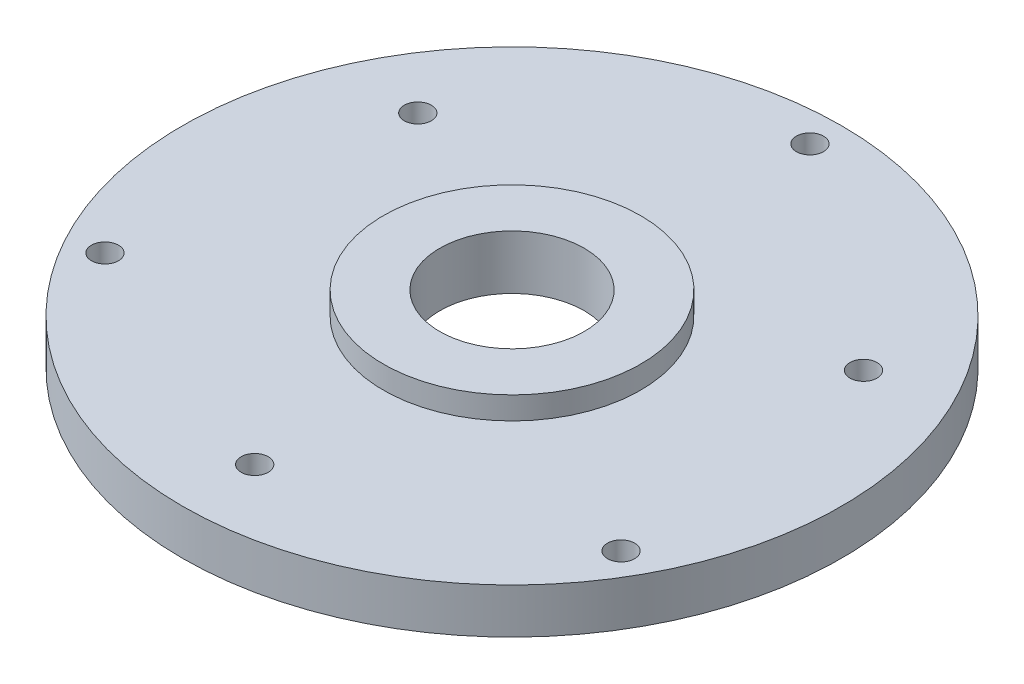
ISO-10303-21;
HEADER;
FILE_DESCRIPTION(('STEP AP214'),'2;1');
FILE_NAME('part.step','',(''),(''),'','','');
FILE_SCHEMA(('AUTOMOTIVE_DESIGN { 1 0 10303 214 1 1 1 1 }'));
ENDSEC;
DATA;
#1=APPLICATION_CONTEXT('core data for automotive mechanical design processes');
#2=APPLICATION_PROTOCOL_DEFINITION('international standard','automotive_design',2000,#1);
#3=PRODUCT_CONTEXT('',#1,'mechanical');
#4=PRODUCT('Part','Part','',(#3));
#5=PRODUCT_RELATED_PRODUCT_CATEGORY('part','',(#4));
#6=PRODUCT_DEFINITION_FORMATION('','',#4);
#7=PRODUCT_DEFINITION_CONTEXT('part definition',#1,'design');
#8=PRODUCT_DEFINITION('design','',#6,#7);
#9=PRODUCT_DEFINITION_SHAPE('','',#8);
#10=(LENGTH_UNIT() NAMED_UNIT(*) SI_UNIT(.MILLI.,.METRE.));
#11=(NAMED_UNIT(*) PLANE_ANGLE_UNIT() SI_UNIT($,.RADIAN.));
#12=(NAMED_UNIT(*) SI_UNIT($,.STERADIAN.) SOLID_ANGLE_UNIT());
#13=UNCERTAINTY_MEASURE_WITH_UNIT(LENGTH_MEASURE(1.E-05),#10,'distance_accuracy_value','');
#14=(GEOMETRIC_REPRESENTATION_CONTEXT(3) GLOBAL_UNCERTAINTY_ASSIGNED_CONTEXT((#13)) GLOBAL_UNIT_ASSIGNED_CONTEXT((#10,
#11,#12)) REPRESENTATION_CONTEXT('',''));
#15=CARTESIAN_POINT('',(0.,0.,0.));
#16=DIRECTION('',(0.,0.,1.));
#17=DIRECTION('',(1.,0.,0.));
#18=AXIS2_PLACEMENT_3D('',#15,#16,#17);
#19=CARTESIAN_POINT('',(0.,0.,0.));
#20=DIRECTION('',(0.,-1.,0.));
#21=DIRECTION('',(0.,0.,-1.));
#22=AXIS2_PLACEMENT_3D('',#19,#20,#21);
#23=CYLINDRICAL_SURFACE('',#22,14.25);
#24=CARTESIAN_POINT('',(0.,41.8859311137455,0.));
#25=DIRECTION('',(0.,-1.,0.));
#26=DIRECTION('',(0.,0.,-1.));
#27=AXIS2_PLACEMENT_3D('',#24,#25,#26);
#28=CIRCLE('',#27,14.25);
#29=CARTESIAN_POINT('',(0.,41.8859311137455,-14.25));
#30=VERTEX_POINT('',#29);
#31=EDGE_CURVE('E10',#30,#30,#28,.T.);
#32=ORIENTED_EDGE('',*,*,#31,.T.);
#33=EDGE_LOOP('',(#32));
#34=FACE_BOUND('',#33,.T.);
#35=CARTESIAN_POINT('',(0.,39.3859311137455,0.));
#36=DIRECTION('',(0.,-1.,0.));
#37=DIRECTION('',(0.,0.,-1.));
#38=AXIS2_PLACEMENT_3D('',#35,#36,#37);
#39=CIRCLE('',#38,14.25);
#40=CARTESIAN_POINT('',(0.,39.3859311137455,-14.25));
#41=VERTEX_POINT('',#40);
#42=EDGE_CURVE('E93',#41,#41,#39,.T.);
#43=ORIENTED_EDGE('',*,*,#42,.F.);
#44=EDGE_LOOP('',(#43));
#45=FACE_BOUND('',#44,.T.);
#46=ADVANCED_FACE('F45',(#34,#45),#23,.T.);
#47=CARTESIAN_POINT('',(8.,41.8859311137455,0.));
#48=DIRECTION('',(0.,1.,0.));
#49=DIRECTION('',(0.,0.,1.));
#50=AXIS2_PLACEMENT_3D('',#47,#48,#49);
#51=PLANE('',#50);
#52=CARTESIAN_POINT('',(0.,41.8859311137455,0.));
#53=DIRECTION('',(0.,-1.,0.));
#54=DIRECTION('',(0.,0.,-1.));
#55=AXIS2_PLACEMENT_3D('',#52,#53,#54);
#56=CIRCLE('',#55,8.);
#57=CARTESIAN_POINT('',(0.,41.8859311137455,-8.));
#58=VERTEX_POINT('',#57);
#59=EDGE_CURVE('E53',#58,#58,#56,.T.);
#60=ORIENTED_EDGE('',*,*,#59,.T.);
#61=EDGE_LOOP('',(#60));
#62=FACE_BOUND('',#61,.T.);
#63=ORIENTED_EDGE('',*,*,#31,.F.);
#64=EDGE_LOOP('',(#63));
#65=FACE_BOUND('',#64,.T.);
#66=ADVANCED_FACE('F133',(#62,#65),#51,.T.);
#67=CARTESIAN_POINT('',(0.,0.,0.));
#68=DIRECTION('',(0.,-1.,0.));
#69=DIRECTION('',(0.,0.,-1.));
#70=AXIS2_PLACEMENT_3D('',#67,#68,#69);
#71=CYLINDRICAL_SURFACE('',#70,8.);
#72=CARTESIAN_POINT('',(0.,35.8859311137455,0.));
#73=DIRECTION('',(0.,-1.,0.));
#74=DIRECTION('',(0.,0.,-1.));
#75=AXIS2_PLACEMENT_3D('',#72,#73,#74);
#76=CIRCLE('',#75,8.);
#77=CARTESIAN_POINT('',(0.,35.8859311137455,-8.));
#78=VERTEX_POINT('',#77);
#79=EDGE_CURVE('E60',#78,#78,#76,.T.);
#80=ORIENTED_EDGE('',*,*,#79,.T.);
#81=EDGE_LOOP('',(#80));
#82=FACE_BOUND('',#81,.T.);
#83=ORIENTED_EDGE('',*,*,#59,.F.);
#84=EDGE_LOOP('',(#83));
#85=FACE_BOUND('',#84,.T.);
#86=ADVANCED_FACE('F118',(#82,#85),#71,.F.);
#87=CARTESIAN_POINT('',(14.,35.8859311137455,0.));
#88=DIRECTION('',(0.,-1.,0.));
#89=DIRECTION('',(0.,0.,-1.));
#90=AXIS2_PLACEMENT_3D('',#87,#88,#89);
#91=PLANE('',#90);
#92=CARTESIAN_POINT('',(0.,35.8859311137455,0.));
#93=DIRECTION('',(0.,-1.,0.));
#94=DIRECTION('',(0.,0.,-1.));
#95=AXIS2_PLACEMENT_3D('',#92,#93,#94);
#96=CIRCLE('',#95,14.);
#97=CARTESIAN_POINT('',(0.,35.8859311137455,-14.));
#98=VERTEX_POINT('',#97);
#99=EDGE_CURVE('E110',#98,#98,#96,.T.);
#100=ORIENTED_EDGE('',*,*,#99,.T.);
#101=EDGE_LOOP('',(#100));
#102=FACE_BOUND('',#101,.T.);
#103=ORIENTED_EDGE('',*,*,#79,.F.);
#104=EDGE_LOOP('',(#103));
#105=FACE_BOUND('',#104,.T.);
#106=ADVANCED_FACE('F121',(#102,#105),#91,.T.);
#107=CARTESIAN_POINT('',(0.,0.,0.));
#108=DIRECTION('',(0.,-1.,0.));
#109=DIRECTION('',(0.,0.,-1.));
#110=AXIS2_PLACEMENT_3D('',#107,#108,#109);
#111=CYLINDRICAL_SURFACE('',#110,14.);
#112=CARTESIAN_POINT('',(0.,34.3859311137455,0.));
#113=DIRECTION('',(0.,-1.,0.));
#114=DIRECTION('',(0.,0.,-1.));
#115=AXIS2_PLACEMENT_3D('',#112,#113,#114);
#116=CIRCLE('',#115,14.);
#117=CARTESIAN_POINT('',(0.,34.3859311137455,-14.));
#118=VERTEX_POINT('',#117);
#119=EDGE_CURVE('E106',#118,#118,#116,.T.);
#120=ORIENTED_EDGE('',*,*,#119,.T.);
#121=EDGE_LOOP('',(#120));
#122=FACE_BOUND('',#121,.T.);
#123=ORIENTED_EDGE('',*,*,#99,.F.);
#124=EDGE_LOOP('',(#123));
#125=FACE_BOUND('',#124,.T.);
#126=ADVANCED_FACE('F123',(#122,#125),#111,.F.);
#127=CARTESIAN_POINT('',(14.,34.3859311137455,0.));
#128=DIRECTION('',(0.,-1.,0.));
#129=DIRECTION('',(0.,0.,-1.));
#130=AXIS2_PLACEMENT_3D('',#127,#128,#129);
#131=PLANE('',#130);
#132=CARTESIAN_POINT('',(0.,34.3859311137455,28.5));
#133=DIRECTION('',(0.,-1.,0.));
#134=DIRECTION('',(0.,0.,-1.));
#135=AXIS2_PLACEMENT_3D('',#132,#133,#134);
#136=CIRCLE('',#135,1.5);
#137=CARTESIAN_POINT('',(0.,34.3859311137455,27.));
#138=VERTEX_POINT('',#137);
#139=EDGE_CURVE('E68',#138,#138,#136,.T.);
#140=ORIENTED_EDGE('',*,*,#139,.F.);
#141=EDGE_LOOP('',(#140));
#142=FACE_BOUND('',#141,.T.);
#143=CARTESIAN_POINT('',(24.6817240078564,34.3859311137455,-14.2500000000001));
#144=DIRECTION('',(0.,-1.,0.));
#145=DIRECTION('',(0.,0.,-1.));
#146=AXIS2_PLACEMENT_3D('',#143,#144,#145);
#147=CIRCLE('',#146,1.5);
#148=CARTESIAN_POINT('',(24.6817240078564,34.3859311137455,-15.7500000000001));
#149=VERTEX_POINT('',#148);
#150=EDGE_CURVE('E194',#149,#149,#147,.T.);
#151=ORIENTED_EDGE('',*,*,#150,.F.);
#152=EDGE_LOOP('',(#151));
#153=FACE_BOUND('',#152,.T.);
#154=CARTESIAN_POINT('',(-24.6817240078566,34.3859311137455,-14.2499999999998));
#155=DIRECTION('',(0.,-1.,0.));
#156=DIRECTION('',(0.,0.,-1.));
#157=AXIS2_PLACEMENT_3D('',#154,#155,#156);
#158=CIRCLE('',#157,1.5);
#159=CARTESIAN_POINT('',(-24.6817240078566,34.3859311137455,-15.7499999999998));
#160=VERTEX_POINT('',#159);
#161=EDGE_CURVE('E199',#160,#160,#158,.T.);
#162=ORIENTED_EDGE('',*,*,#161,.F.);
#163=EDGE_LOOP('',(#162));
#164=FACE_BOUND('',#163,.T.);
#165=CARTESIAN_POINT('',(0.,34.3859311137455,-33.));
#166=DIRECTION('',(0.,1.,0.));
#167=DIRECTION('',(0.,0.,1.));
#168=AXIS2_PLACEMENT_3D('',#165,#166,#167);
#169=CIRCLE('',#168,1.5);
#170=CARTESIAN_POINT('',(0.,34.3859311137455,-31.5));
#171=VERTEX_POINT('',#170);
#172=EDGE_CURVE('E98',#171,#171,#169,.T.);
#173=ORIENTED_EDGE('',*,*,#172,.T.);
#174=EDGE_LOOP('',(#173));
#175=FACE_BOUND('',#174,.T.);
#176=CARTESIAN_POINT('',(28.5788383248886,34.3859311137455,16.4999999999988));
#177=DIRECTION('',(0.,1.,0.));
#178=DIRECTION('',(0.,0.,1.));
#179=AXIS2_PLACEMENT_3D('',#176,#177,#178);
#180=CIRCLE('',#179,1.5000000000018);
#181=CARTESIAN_POINT('',(28.5788383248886,34.3859311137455,18.0000000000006));
#182=VERTEX_POINT('',#181);
#183=EDGE_CURVE('E212',#182,#182,#180,.T.);
#184=ORIENTED_EDGE('',*,*,#183,.T.);
#185=EDGE_LOOP('',(#184));
#186=FACE_BOUND('',#185,.T.);
#187=CARTESIAN_POINT('',(-28.5788383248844,34.3859311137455,16.5000000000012));
#188=DIRECTION('',(0.,1.,0.));
#189=DIRECTION('',(0.,0.,1.));
#190=AXIS2_PLACEMENT_3D('',#187,#188,#189);
#191=CIRCLE('',#190,1.50000000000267);
#192=CARTESIAN_POINT('',(-28.5788383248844,34.3859311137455,18.0000000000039));
#193=VERTEX_POINT('',#192);
#194=EDGE_CURVE('E82',#193,#193,#191,.T.);
#195=ORIENTED_EDGE('',*,*,#194,.T.);
#196=EDGE_LOOP('',(#195));
#197=FACE_BOUND('',#196,.T.);
#198=CARTESIAN_POINT('',(0.,34.3859311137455,0.));
#199=DIRECTION('',(0.,-1.,0.));
#200=DIRECTION('',(0.,0.,-1.));
#201=AXIS2_PLACEMENT_3D('',#198,#199,#200);
#202=CIRCLE('',#201,36.5);
#203=CARTESIAN_POINT('',(0.,34.3859311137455,-36.5));
#204=VERTEX_POINT('',#203);
#205=EDGE_CURVE('E102',#204,#204,#202,.T.);
#206=ORIENTED_EDGE('',*,*,#205,.T.);
#207=EDGE_LOOP('',(#206));
#208=FACE_BOUND('',#207,.T.);
#209=ORIENTED_EDGE('',*,*,#119,.F.);
#210=EDGE_LOOP('',(#209));
#211=FACE_BOUND('',#210,.T.);
#212=ADVANCED_FACE('F130',(#142,#153,#164,#175,#186,#197,#208,#211),#131,.T.);
#213=CARTESIAN_POINT('',(0.,0.,0.));
#214=DIRECTION('',(0.,-1.,0.));
#215=DIRECTION('',(0.,0.,-1.));
#216=AXIS2_PLACEMENT_3D('',#213,#214,#215);
#217=CYLINDRICAL_SURFACE('',#216,36.5);
#218=CARTESIAN_POINT('',(0.,39.3859311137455,0.));
#219=DIRECTION('',(0.,-1.,0.));
#220=DIRECTION('',(0.,0.,-1.));
#221=AXIS2_PLACEMENT_3D('',#218,#219,#220);
#222=CIRCLE('',#221,36.5);
#223=CARTESIAN_POINT('',(0.,39.3859311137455,-36.5));
#224=VERTEX_POINT('',#223);
#225=EDGE_CURVE('E97',#224,#224,#222,.T.);
#226=ORIENTED_EDGE('',*,*,#225,.T.);
#227=EDGE_LOOP('',(#226));
#228=FACE_BOUND('',#227,.T.);
#229=ORIENTED_EDGE('',*,*,#205,.F.);
#230=EDGE_LOOP('',(#229));
#231=FACE_BOUND('',#230,.T.);
#232=ADVANCED_FACE('F147',(#228,#231),#217,.T.);
#233=CARTESIAN_POINT('',(14.25,39.3859311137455,0.));
#234=DIRECTION('',(0.,1.,0.));
#235=DIRECTION('',(0.,0.,1.));
#236=AXIS2_PLACEMENT_3D('',#233,#234,#235);
#237=PLANE('',#236);
#238=CARTESIAN_POINT('',(0.,39.3859311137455,28.5));
#239=DIRECTION('',(0.,1.,0.));
#240=DIRECTION('',(0.,0.,1.));
#241=AXIS2_PLACEMENT_3D('',#238,#239,#240);
#242=CIRCLE('',#241,1.5);
#243=CARTESIAN_POINT('',(0.,39.3859311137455,30.));
#244=VERTEX_POINT('',#243);
#245=EDGE_CURVE('E48',#244,#244,#242,.T.);
#246=ORIENTED_EDGE('',*,*,#245,.F.);
#247=EDGE_LOOP('',(#246));
#248=FACE_BOUND('',#247,.T.);
#249=CARTESIAN_POINT('',(24.6817240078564,39.3859311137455,-14.2500000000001));
#250=DIRECTION('',(0.,1.,0.));
#251=DIRECTION('',(0.,0.,1.));
#252=AXIS2_PLACEMENT_3D('',#249,#250,#251);
#253=CIRCLE('',#252,1.5);
#254=CARTESIAN_POINT('',(24.6817240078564,39.3859311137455,-12.7500000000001));
#255=VERTEX_POINT('',#254);
#256=EDGE_CURVE('E67',#255,#255,#253,.T.);
#257=ORIENTED_EDGE('',*,*,#256,.F.);
#258=EDGE_LOOP('',(#257));
#259=FACE_BOUND('',#258,.T.);
#260=CARTESIAN_POINT('',(-24.6817240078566,39.3859311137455,-14.2499999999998));
#261=DIRECTION('',(0.,1.,0.));
#262=DIRECTION('',(0.,0.,1.));
#263=AXIS2_PLACEMENT_3D('',#260,#261,#262);
#264=CIRCLE('',#263,1.5);
#265=CARTESIAN_POINT('',(-24.6817240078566,39.3859311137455,-12.7499999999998));
#266=VERTEX_POINT('',#265);
#267=EDGE_CURVE('E64',#266,#266,#264,.T.);
#268=ORIENTED_EDGE('',*,*,#267,.F.);
#269=EDGE_LOOP('',(#268));
#270=FACE_BOUND('',#269,.T.);
#271=CARTESIAN_POINT('',(0.,39.3859311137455,-33.));
#272=DIRECTION('',(0.,1.,0.));
#273=DIRECTION('',(0.,0.,1.));
#274=AXIS2_PLACEMENT_3D('',#271,#272,#273);
#275=CIRCLE('',#274,1.5);
#276=CARTESIAN_POINT('',(0.,39.3859311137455,-31.5));
#277=VERTEX_POINT('',#276);
#278=EDGE_CURVE('E208',#277,#277,#275,.T.);
#279=ORIENTED_EDGE('',*,*,#278,.F.);
#280=EDGE_LOOP('',(#279));
#281=FACE_BOUND('',#280,.T.);
#282=CARTESIAN_POINT('',(28.5788383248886,39.3859311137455,16.4999999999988));
#283=DIRECTION('',(0.,1.,0.));
#284=DIRECTION('',(0.,0.,1.));
#285=AXIS2_PLACEMENT_3D('',#282,#283,#284);
#286=CIRCLE('',#285,1.5000000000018);
#287=CARTESIAN_POINT('',(28.5788383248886,39.3859311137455,18.0000000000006));
#288=VERTEX_POINT('',#287);
#289=EDGE_CURVE('E89',#288,#288,#286,.T.);
#290=ORIENTED_EDGE('',*,*,#289,.F.);
#291=EDGE_LOOP('',(#290));
#292=FACE_BOUND('',#291,.T.);
#293=CARTESIAN_POINT('',(-28.5788383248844,39.3859311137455,16.5000000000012));
#294=DIRECTION('',(0.,1.,0.));
#295=DIRECTION('',(0.,0.,1.));
#296=AXIS2_PLACEMENT_3D('',#293,#294,#295);
#297=CIRCLE('',#296,1.50000000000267);
#298=CARTESIAN_POINT('',(-28.5788383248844,39.3859311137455,18.0000000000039));
#299=VERTEX_POINT('',#298);
#300=EDGE_CURVE('E76',#299,#299,#297,.T.);
#301=ORIENTED_EDGE('',*,*,#300,.F.);
#302=EDGE_LOOP('',(#301));
#303=FACE_BOUND('',#302,.T.);
#304=ORIENTED_EDGE('',*,*,#42,.T.);
#305=EDGE_LOOP('',(#304));
#306=FACE_BOUND('',#305,.T.);
#307=ORIENTED_EDGE('',*,*,#225,.F.);
#308=EDGE_LOOP('',(#307));
#309=FACE_BOUND('',#308,.T.);
#310=ADVANCED_FACE('F143',(#248,#259,#270,#281,#292,#303,#306,#309),#237,.T.);
#311=CARTESIAN_POINT('',(-28.5788383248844,34.3859311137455,16.5000000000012));
#312=DIRECTION('',(0.,1.,0.));
#313=DIRECTION('',(0.,0.,1.));
#314=AXIS2_PLACEMENT_3D('',#311,#312,#313);
#315=CYLINDRICAL_SURFACE('',#314,1.50000000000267);
#316=ORIENTED_EDGE('',*,*,#194,.F.);
#317=EDGE_LOOP('',(#316));
#318=FACE_BOUND('',#317,.T.);
#319=ORIENTED_EDGE('',*,*,#300,.T.);
#320=EDGE_LOOP('',(#319));
#321=FACE_BOUND('',#320,.T.);
#322=ADVANCED_FACE('F146',(#318,#321),#315,.F.);
#323=CARTESIAN_POINT('',(28.5788383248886,34.3859311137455,16.4999999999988));
#324=DIRECTION('',(0.,1.,0.));
#325=DIRECTION('',(0.,0.,1.));
#326=AXIS2_PLACEMENT_3D('',#323,#324,#325);
#327=CYLINDRICAL_SURFACE('',#326,1.5000000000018);
#328=ORIENTED_EDGE('',*,*,#183,.F.);
#329=EDGE_LOOP('',(#328));
#330=FACE_BOUND('',#329,.T.);
#331=ORIENTED_EDGE('',*,*,#289,.T.);
#332=EDGE_LOOP('',(#331));
#333=FACE_BOUND('',#332,.T.);
#334=ADVANCED_FACE('F171',(#330,#333),#327,.F.);
#335=CARTESIAN_POINT('',(0.,34.3859311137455,-33.));
#336=DIRECTION('',(0.,1.,0.));
#337=DIRECTION('',(0.,0.,1.));
#338=AXIS2_PLACEMENT_3D('',#335,#336,#337);
#339=CYLINDRICAL_SURFACE('',#338,1.5);
#340=ORIENTED_EDGE('',*,*,#172,.F.);
#341=EDGE_LOOP('',(#340));
#342=FACE_BOUND('',#341,.T.);
#343=ORIENTED_EDGE('',*,*,#278,.T.);
#344=EDGE_LOOP('',(#343));
#345=FACE_BOUND('',#344,.T.);
#346=ADVANCED_FACE('F175',(#342,#345),#339,.F.);
#347=CARTESIAN_POINT('',(-24.6817240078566,41.8859311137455,-14.2499999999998));
#348=DIRECTION('',(0.,-1.,0.));
#349=DIRECTION('',(0.,0.,-1.));
#350=AXIS2_PLACEMENT_3D('',#347,#348,#349);
#351=CYLINDRICAL_SURFACE('',#350,1.5);
#352=ORIENTED_EDGE('',*,*,#267,.T.);
#353=EDGE_LOOP('',(#352));
#354=FACE_BOUND('',#353,.T.);
#355=ORIENTED_EDGE('',*,*,#161,.T.);
#356=EDGE_LOOP('',(#355));
#357=FACE_BOUND('',#356,.T.);
#358=ADVANCED_FACE('F179',(#354,#357),#351,.F.);
#359=CARTESIAN_POINT('',(24.6817240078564,41.8859311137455,-14.2500000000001));
#360=DIRECTION('',(0.,-1.,0.));
#361=DIRECTION('',(0.,0.,-1.));
#362=AXIS2_PLACEMENT_3D('',#359,#360,#361);
#363=CYLINDRICAL_SURFACE('',#362,1.5);
#364=ORIENTED_EDGE('',*,*,#256,.T.);
#365=EDGE_LOOP('',(#364));
#366=FACE_BOUND('',#365,.T.);
#367=ORIENTED_EDGE('',*,*,#150,.T.);
#368=EDGE_LOOP('',(#367));
#369=FACE_BOUND('',#368,.T.);
#370=ADVANCED_FACE('F183',(#366,#369),#363,.F.);
#371=CARTESIAN_POINT('',(0.,41.8859311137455,28.5));
#372=DIRECTION('',(0.,-1.,0.));
#373=DIRECTION('',(0.,0.,-1.));
#374=AXIS2_PLACEMENT_3D('',#371,#372,#373);
#375=CYLINDRICAL_SURFACE('',#374,1.5);
#376=ORIENTED_EDGE('',*,*,#245,.T.);
#377=EDGE_LOOP('',(#376));
#378=FACE_BOUND('',#377,.T.);
#379=ORIENTED_EDGE('',*,*,#139,.T.);
#380=EDGE_LOOP('',(#379));
#381=FACE_BOUND('',#380,.T.);
#382=ADVANCED_FACE('F187',(#378,#381),#375,.F.);
#383=CLOSED_SHELL('',(#46,#66,#86,#106,#126,#212,#232,#310,#322,#334,#346,#358,#370,#382));
#384=MANIFOLD_SOLID_BREP('B2',#383);
#385=ADVANCED_BREP_SHAPE_REPRESENTATION('',(#18,#384),#14);
#386=SHAPE_DEFINITION_REPRESENTATION(#9,#385);
ENDSEC;
END-ISO-10303-21;
